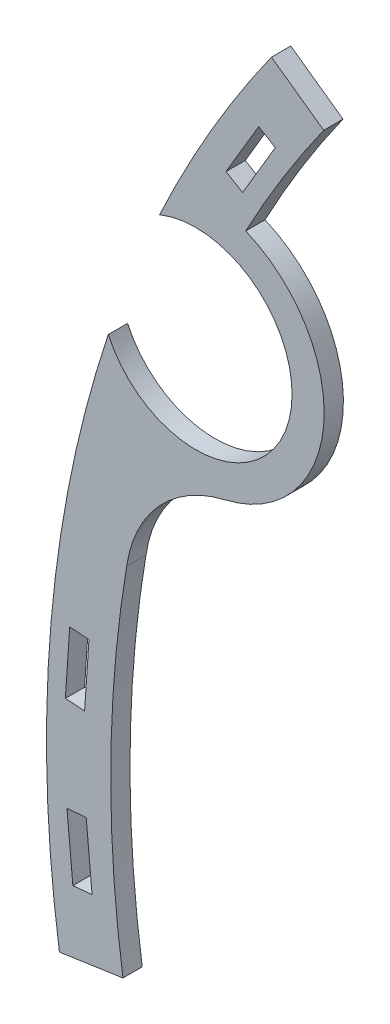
ISO-10303-21;
HEADER;
FILE_DESCRIPTION(('STEP AP214'),'2;1');
FILE_NAME('part.step','',(''),(''),'','','');
FILE_SCHEMA(('AUTOMOTIVE_DESIGN { 1 0 10303 214 1 1 1 1 }'));
ENDSEC;
DATA;
#1=APPLICATION_CONTEXT('core data for automotive mechanical design processes');
#2=APPLICATION_PROTOCOL_DEFINITION('international standard','automotive_design',2000,#1);
#3=PRODUCT_CONTEXT('',#1,'mechanical');
#4=PRODUCT('Part','Part','',(#3));
#5=PRODUCT_RELATED_PRODUCT_CATEGORY('part','',(#4));
#6=PRODUCT_DEFINITION_FORMATION('','',#4);
#7=PRODUCT_DEFINITION_CONTEXT('part definition',#1,'design');
#8=PRODUCT_DEFINITION('design','',#6,#7);
#9=PRODUCT_DEFINITION_SHAPE('','',#8);
#10=(LENGTH_UNIT() NAMED_UNIT(*) SI_UNIT(.MILLI.,.METRE.));
#11=(NAMED_UNIT(*) PLANE_ANGLE_UNIT() SI_UNIT($,.RADIAN.));
#12=(NAMED_UNIT(*) SI_UNIT($,.STERADIAN.) SOLID_ANGLE_UNIT());
#13=UNCERTAINTY_MEASURE_WITH_UNIT(LENGTH_MEASURE(1.E-05),#10,'distance_accuracy_value','');
#14=(GEOMETRIC_REPRESENTATION_CONTEXT(3) GLOBAL_UNCERTAINTY_ASSIGNED_CONTEXT((#13)) GLOBAL_UNIT_ASSIGNED_CONTEXT((#10,
#11,#12)) REPRESENTATION_CONTEXT('',''));
#15=CARTESIAN_POINT('',(0.,0.,0.));
#16=DIRECTION('',(0.,0.,1.));
#17=DIRECTION('',(1.,0.,0.));
#18=AXIS2_PLACEMENT_3D('',#15,#16,#17);
#19=CARTESIAN_POINT('',(-0.335882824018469,3.64820701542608,3.));
#20=DIRECTION('',(-0.0916801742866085,0.995788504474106,0.));
#21=DIRECTION('',(-0.995788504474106,-0.0916801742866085,0.));
#22=AXIS2_PLACEMENT_3D('',#19,#20,#21);
#23=PLANE('',#22);
#24=DIRECTION('',(0.995788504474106,0.0916801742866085,0.));
#25=VECTOR('',#24,1.);
#26=CARTESIAN_POINT('',(-0.335882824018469,3.64820701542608,0.));
#27=LINE('',#26,#25);
#28=CARTESIAN_POINT('',(-186.108637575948,-13.4555037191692,0.));
#29=VERTEX_POINT('',#28);
#30=CARTESIAN_POINT('',(-183.114306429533,-13.1798218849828,0.));
#31=VERTEX_POINT('',#30);
#32=EDGE_CURVE('E257',#29,#31,#27,.T.);
#33=ORIENTED_EDGE('',*,*,#32,.T.);
#34=DIRECTION('',(0.,0.,-1.));
#35=VECTOR('',#34,1.);
#36=CARTESIAN_POINT('',(-183.114306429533,-13.1798218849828,3.));
#37=LINE('',#36,#35);
#38=CARTESIAN_POINT('',(-183.114306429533,-13.1798218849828,3.));
#39=VERTEX_POINT('',#38);
#40=EDGE_CURVE('E11',#39,#31,#37,.T.);
#41=ORIENTED_EDGE('',*,*,#40,.F.);
#42=DIRECTION('',(0.995788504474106,0.0916801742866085,0.));
#43=VECTOR('',#42,1.);
#44=CARTESIAN_POINT('',(-0.335882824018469,3.64820701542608,3.));
#45=LINE('',#44,#43);
#46=CARTESIAN_POINT('',(-186.108637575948,-13.4555037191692,3.));
#47=VERTEX_POINT('',#46);
#48=EDGE_CURVE('E192',#47,#39,#45,.T.);
#49=ORIENTED_EDGE('',*,*,#48,.F.);
#50=DIRECTION('',(0.,0.,-1.));
#51=VECTOR('',#50,1.);
#52=CARTESIAN_POINT('',(-186.108637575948,-13.4555037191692,3.));
#53=LINE('',#52,#51);
#54=EDGE_CURVE('E54',#47,#29,#53,.T.);
#55=ORIENTED_EDGE('',*,*,#54,.T.);
#56=EDGE_LOOP('',(#33,#41,#49,#55));
#57=FACE_BOUND('',#56,.T.);
#58=ADVANCED_FACE('F35',(#57),#23,.F.);
#59=CARTESIAN_POINT('',(-182.778423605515,-16.8280289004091,3.));
#60=DIRECTION('',(0.995788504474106,0.0916801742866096,0.));
#61=DIRECTION('',(-0.0916801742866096,0.995788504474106,0.));
#62=AXIS2_PLACEMENT_3D('',#59,#60,#61);
#63=PLANE('',#62);
#64=DIRECTION('',(0.0916801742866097,-0.995788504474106,0.));
#65=VECTOR('',#64,1.);
#66=CARTESIAN_POINT('',(-182.778423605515,-16.8280289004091,0.));
#67=LINE('',#66,#65);
#68=CARTESIAN_POINT('',(-182.197504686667,-23.1377069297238,0.));
#69=VERTEX_POINT('',#68);
#70=EDGE_CURVE('E198',#31,#69,#67,.T.);
#71=ORIENTED_EDGE('',*,*,#70,.T.);
#72=DIRECTION('',(0.,0.,-1.));
#73=VECTOR('',#72,1.);
#74=CARTESIAN_POINT('',(-182.197504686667,-23.1377069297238,3.));
#75=LINE('',#74,#73);
#76=CARTESIAN_POINT('',(-182.197504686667,-23.1377069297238,3.));
#77=VERTEX_POINT('',#76);
#78=EDGE_CURVE('E45',#77,#69,#75,.T.);
#79=ORIENTED_EDGE('',*,*,#78,.F.);
#80=DIRECTION('',(0.0916801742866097,-0.995788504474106,0.));
#81=VECTOR('',#80,1.);
#82=CARTESIAN_POINT('',(-182.778423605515,-16.8280289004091,3.));
#83=LINE('',#82,#81);
#84=EDGE_CURVE('E186',#39,#77,#83,.T.);
#85=ORIENTED_EDGE('',*,*,#84,.F.);
#86=ORIENTED_EDGE('',*,*,#40,.T.);
#87=EDGE_LOOP('',(#71,#79,#85,#86));
#88=FACE_BOUND('',#87,.T.);
#89=ADVANCED_FACE('F197',(#88),#63,.F.);
#90=CARTESIAN_POINT('',(0.580918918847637,-6.30967802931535,3.));
#91=DIRECTION('',(-0.0916801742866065,0.995788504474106,0.));
#92=DIRECTION('',(-0.995788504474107,-0.0916801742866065,0.));
#93=AXIS2_PLACEMENT_3D('',#90,#91,#92);
#94=PLANE('',#93);
#95=DIRECTION('',(0.995788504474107,0.0916801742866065,0.));
#96=VECTOR('',#95,1.);
#97=CARTESIAN_POINT('',(0.580918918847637,-6.30967802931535,0.));
#98=LINE('',#97,#96);
#99=CARTESIAN_POINT('',(-185.191835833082,-23.4133887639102,0.));
#100=VERTEX_POINT('',#99);
#101=EDGE_CURVE('E260',#100,#69,#98,.T.);
#102=ORIENTED_EDGE('',*,*,#101,.F.);
#103=DIRECTION('',(0.,0.,-1.));
#104=VECTOR('',#103,1.);
#105=CARTESIAN_POINT('',(-185.191835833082,-23.4133887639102,3.));
#106=LINE('',#105,#104);
#107=CARTESIAN_POINT('',(-185.191835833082,-23.4133887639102,3.));
#108=VERTEX_POINT('',#107);
#109=EDGE_CURVE('E119',#108,#100,#106,.T.);
#110=ORIENTED_EDGE('',*,*,#109,.F.);
#111=DIRECTION('',(0.995788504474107,0.0916801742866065,0.));
#112=VECTOR('',#111,1.);
#113=CARTESIAN_POINT('',(0.580918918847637,-6.30967802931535,3.));
#114=LINE('',#113,#112);
#115=EDGE_CURVE('E191',#108,#77,#114,.T.);
#116=ORIENTED_EDGE('',*,*,#115,.T.);
#117=ORIENTED_EDGE('',*,*,#78,.T.);
#118=EDGE_LOOP('',(#102,#110,#116,#117));
#119=FACE_BOUND('',#118,.T.);
#120=ADVANCED_FACE('F202',(#119),#94,.T.);
#121=CARTESIAN_POINT('',(-182.586507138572,12.4759264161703,3.));
#122=DIRECTION('',(-0.997673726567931,0.068169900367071,0.));
#123=DIRECTION('',(-0.068169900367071,-0.997673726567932,0.));
#124=AXIS2_PLACEMENT_3D('',#121,#122,#123);
#125=PLANE('',#124);
#126=DIRECTION('',(0.068169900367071,0.997673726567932,0.));
#127=VECTOR('',#126,1.);
#128=CARTESIAN_POINT('',(-182.586507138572,12.4759264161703,0.));
#129=LINE('',#128,#127);
#130=CARTESIAN_POINT('',(-183.36625925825,1.06417139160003,0.));
#131=VERTEX_POINT('',#130);
#132=CARTESIAN_POINT('',(-182.684560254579,11.0409086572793,0.));
#133=VERTEX_POINT('',#132);
#134=EDGE_CURVE('E245',#131,#133,#129,.T.);
#135=ORIENTED_EDGE('',*,*,#134,.F.);
#136=DIRECTION('',(0.,0.,-1.));
#137=VECTOR('',#136,1.);
#138=CARTESIAN_POINT('',(-183.36625925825,1.06417139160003,3.));
#139=LINE('',#138,#137);
#140=CARTESIAN_POINT('',(-183.36625925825,1.06417139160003,3.));
#141=VERTEX_POINT('',#140);
#142=EDGE_CURVE('E267',#141,#131,#139,.T.);
#143=ORIENTED_EDGE('',*,*,#142,.F.);
#144=DIRECTION('',(0.068169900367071,0.997673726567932,0.));
#145=VECTOR('',#144,1.);
#146=CARTESIAN_POINT('',(-182.586507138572,12.4759264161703,3.));
#147=LINE('',#146,#145);
#148=CARTESIAN_POINT('',(-182.684560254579,11.0409086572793,3.));
#149=VERTEX_POINT('',#148);
#150=EDGE_CURVE('E557',#141,#149,#147,.T.);
#151=ORIENTED_EDGE('',*,*,#150,.T.);
#152=DIRECTION('',(0.,0.,-1.));
#153=VECTOR('',#152,1.);
#154=CARTESIAN_POINT('',(-182.684560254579,11.0409086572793,3.));
#155=LINE('',#154,#153);
#156=EDGE_CURVE('E269',#149,#133,#155,.T.);
#157=ORIENTED_EDGE('',*,*,#156,.T.);
#158=EDGE_LOOP('',(#135,#143,#151,#157));
#159=FACE_BOUND('',#158,.T.);
#160=ADVANCED_FACE('F376',(#159),#125,.T.);
#161=CARTESIAN_POINT('',(-0.779752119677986,-11.4117550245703,3.));
#162=DIRECTION('',(0.068169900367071,0.997673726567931,0.));
#163=DIRECTION('',(-0.997673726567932,0.068169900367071,0.));
#164=AXIS2_PLACEMENT_3D('',#161,#162,#163);
#165=PLANE('',#164);
#166=DIRECTION('',(0.997673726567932,-0.068169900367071,0.));
#167=VECTOR('',#166,1.);
#168=CARTESIAN_POINT('',(-0.779752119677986,-11.4117550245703,0.));
#169=LINE('',#168,#167);
#170=CARTESIAN_POINT('',(-186.36625925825,1.26915794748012,0.));
#171=VERTEX_POINT('',#170);
#172=EDGE_CURVE('E248',#171,#131,#169,.T.);
#173=ORIENTED_EDGE('',*,*,#172,.F.);
#174=DIRECTION('',(0.,0.,-1.));
#175=VECTOR('',#174,1.);
#176=CARTESIAN_POINT('',(-186.36625925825,1.26915794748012,3.));
#177=LINE('',#176,#175);
#178=CARTESIAN_POINT('',(-186.36625925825,1.26915794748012,3.));
#179=VERTEX_POINT('',#178);
#180=EDGE_CURVE('E275',#179,#171,#177,.T.);
#181=ORIENTED_EDGE('',*,*,#180,.F.);
#182=DIRECTION('',(0.997673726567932,-0.068169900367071,0.));
#183=VECTOR('',#182,1.);
#184=CARTESIAN_POINT('',(-0.779752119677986,-11.4117550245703,3.));
#185=LINE('',#184,#183);
#186=EDGE_CURVE('E560',#179,#141,#185,.T.);
#187=ORIENTED_EDGE('',*,*,#186,.T.);
#188=ORIENTED_EDGE('',*,*,#142,.T.);
#189=EDGE_LOOP('',(#173,#181,#187,#188));
#190=FACE_BOUND('',#189,.T.);
#191=ADVANCED_FACE('F372',(#190),#165,.T.);
#192=CARTESIAN_POINT('',(-185.586507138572,12.6809129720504,3.));
#193=DIRECTION('',(-0.997673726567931,0.068169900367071,0.));
#194=DIRECTION('',(-0.068169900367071,-0.997673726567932,0.));
#195=AXIS2_PLACEMENT_3D('',#192,#193,#194);
#196=PLANE('',#195);
#197=DIRECTION('',(0.068169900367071,0.997673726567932,0.));
#198=VECTOR('',#197,1.);
#199=CARTESIAN_POINT('',(-185.586507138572,12.6809129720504,0.));
#200=LINE('',#199,#198);
#201=CARTESIAN_POINT('',(-185.684560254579,11.2458952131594,0.));
#202=VERTEX_POINT('',#201);
#203=EDGE_CURVE('E251',#171,#202,#200,.T.);
#204=ORIENTED_EDGE('',*,*,#203,.T.);
#205=DIRECTION('',(0.,0.,-1.));
#206=VECTOR('',#205,1.);
#207=CARTESIAN_POINT('',(-185.684560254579,11.2458952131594,3.));
#208=LINE('',#207,#206);
#209=CARTESIAN_POINT('',(-185.684560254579,11.2458952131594,3.));
#210=VERTEX_POINT('',#209);
#211=EDGE_CURVE('E271',#210,#202,#208,.T.);
#212=ORIENTED_EDGE('',*,*,#211,.F.);
#213=DIRECTION('',(0.068169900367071,0.997673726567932,0.));
#214=VECTOR('',#213,1.);
#215=CARTESIAN_POINT('',(-185.586507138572,12.6809129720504,3.));
#216=LINE('',#215,#214);
#217=EDGE_CURVE('E568',#179,#210,#216,.T.);
#218=ORIENTED_EDGE('',*,*,#217,.F.);
#219=ORIENTED_EDGE('',*,*,#180,.T.);
#220=EDGE_LOOP('',(#204,#212,#218,#219));
#221=FACE_BOUND('',#220,.T.);
#222=ADVANCED_FACE('F368',(#221),#196,.F.);
#223=CARTESIAN_POINT('',(-154.085313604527,91.208925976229,3.));
#224=DIRECTION('',(-0.860538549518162,0.509385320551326,0.));
#225=DIRECTION('',(-0.509385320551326,-0.860538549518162,0.));
#226=AXIS2_PLACEMENT_3D('',#223,#224,#225);
#227=PLANE('',#226);
#228=DIRECTION('',(0.509385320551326,0.860538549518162,0.));
#229=VECTOR('',#228,1.);
#230=CARTESIAN_POINT('',(-154.085313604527,91.208925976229,0.));
#231=LINE('',#230,#229);
#232=CARTESIAN_POINT('',(-158.744235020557,83.3382997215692,0.));
#233=VERTEX_POINT('',#232);
#234=CARTESIAN_POINT('',(-153.650381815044,91.9436852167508,0.));
#235=VERTEX_POINT('',#234);
#236=EDGE_CURVE('E233',#233,#235,#231,.T.);
#237=ORIENTED_EDGE('',*,*,#236,.F.);
#238=DIRECTION('',(0.,0.,-1.));
#239=VECTOR('',#238,1.);
#240=CARTESIAN_POINT('',(-158.744235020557,83.3382997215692,3.));
#241=LINE('',#240,#239);
#242=CARTESIAN_POINT('',(-158.744235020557,83.3382997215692,3.));
#243=VERTEX_POINT('',#242);
#244=EDGE_CURVE('E272',#243,#233,#241,.T.);
#245=ORIENTED_EDGE('',*,*,#244,.F.);
#246=DIRECTION('',(0.509385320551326,0.860538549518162,0.));
#247=VECTOR('',#246,1.);
#248=CARTESIAN_POINT('',(-154.085313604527,91.208925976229,3.));
#249=LINE('',#248,#247);
#250=CARTESIAN_POINT('',(-153.650381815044,91.9436852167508,3.));
#251=VERTEX_POINT('',#250);
#252=EDGE_CURVE('E552',#243,#251,#249,.T.);
#253=ORIENTED_EDGE('',*,*,#252,.T.);
#254=DIRECTION('',(0.,0.,-1.));
#255=VECTOR('',#254,1.);
#256=CARTESIAN_POINT('',(-153.650381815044,91.9436852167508,3.));
#257=LINE('',#256,#255);
#258=EDGE_CURVE('E278',#251,#235,#257,.T.);
#259=ORIENTED_EDGE('',*,*,#258,.T.);
#260=EDGE_LOOP('',(#237,#245,#253,#259));
#261=FACE_BOUND('',#260,.T.);
#262=ADVANCED_FACE('F371',(#261),#227,.T.);
#263=CARTESIAN_POINT('',(-4.65892141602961,-7.87062625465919,3.));
#264=DIRECTION('',(0.509385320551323,0.860538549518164,0.));
#265=DIRECTION('',(-0.860538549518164,0.509385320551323,0.));
#266=AXIS2_PLACEMENT_3D('',#263,#264,#265);
#267=PLANE('',#266);
#268=DIRECTION('',(0.860538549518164,-0.509385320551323,0.));
#269=VECTOR('',#268,1.);
#270=CARTESIAN_POINT('',(-4.65892141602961,-7.87062625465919,0.));
#271=LINE('',#270,#269);
#272=CARTESIAN_POINT('',(-161.331870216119,84.8700188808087,0.));
#273=VERTEX_POINT('',#272);
#274=EDGE_CURVE('E236',#273,#233,#271,.T.);
#275=ORIENTED_EDGE('',*,*,#274,.F.);
#276=DIRECTION('',(0.,0.,-1.));
#277=VECTOR('',#276,1.);
#278=CARTESIAN_POINT('',(-161.331870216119,84.8700188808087,3.));
#279=LINE('',#278,#277);
#280=CARTESIAN_POINT('',(-161.331870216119,84.8700188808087,3.));
#281=VERTEX_POINT('',#280);
#282=EDGE_CURVE('E283',#281,#273,#279,.T.);
#283=ORIENTED_EDGE('',*,*,#282,.F.);
#284=DIRECTION('',(0.860538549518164,-0.509385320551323,0.));
#285=VECTOR('',#284,1.);
#286=CARTESIAN_POINT('',(-4.65892141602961,-7.87062625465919,3.));
#287=LINE('',#286,#285);
#288=EDGE_CURVE('E577',#281,#243,#287,.T.);
#289=ORIENTED_EDGE('',*,*,#288,.T.);
#290=ORIENTED_EDGE('',*,*,#244,.T.);
#291=EDGE_LOOP('',(#275,#283,#289,#290));
#292=FACE_BOUND('',#291,.T.);
#293=ADVANCED_FACE('F387',(#292),#267,.T.);
#294=CARTESIAN_POINT('',(-156.672948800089,92.7406451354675,3.));
#295=DIRECTION('',(-0.860538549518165,0.509385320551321,0.));
#296=DIRECTION('',(-0.509385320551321,-0.860538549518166,0.));
#297=AXIS2_PLACEMENT_3D('',#294,#295,#296);
#298=PLANE('',#297);
#299=DIRECTION('',(0.509385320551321,0.860538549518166,0.));
#300=VECTOR('',#299,1.);
#301=CARTESIAN_POINT('',(-156.672948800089,92.7406451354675,0.));
#302=LINE('',#301,#300);
#303=CARTESIAN_POINT('',(-156.238017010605,93.4754043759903,0.));
#304=VERTEX_POINT('',#303);
#305=EDGE_CURVE('E239',#273,#304,#302,.T.);
#306=ORIENTED_EDGE('',*,*,#305,.T.);
#307=DIRECTION('',(0.,0.,-1.));
#308=VECTOR('',#307,1.);
#309=CARTESIAN_POINT('',(-156.238017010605,93.4754043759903,3.));
#310=LINE('',#309,#308);
#311=CARTESIAN_POINT('',(-156.238017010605,93.4754043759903,3.));
#312=VERTEX_POINT('',#311);
#313=EDGE_CURVE('E280',#312,#304,#310,.T.);
#314=ORIENTED_EDGE('',*,*,#313,.F.);
#315=DIRECTION('',(0.509385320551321,0.860538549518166,0.));
#316=VECTOR('',#315,1.);
#317=CARTESIAN_POINT('',(-156.672948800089,92.7406451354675,3.));
#318=LINE('',#317,#316);
#319=EDGE_CURVE('E574',#281,#312,#318,.T.);
#320=ORIENTED_EDGE('',*,*,#319,.F.);
#321=ORIENTED_EDGE('',*,*,#282,.T.);
#322=EDGE_LOOP('',(#306,#314,#320,#321));
#323=FACE_BOUND('',#322,.T.);
#324=ADVANCED_FACE('F384',(#323),#298,.F.);
#325=CARTESIAN_POINT('',(0.,-5.88022373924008,3.));
#326=DIRECTION('',(0.,0.,-1.));
#327=DIRECTION('',(-1.,0.,0.));
#328=AXIS2_PLACEMENT_3D('',#325,#326,#327);
#329=CYLINDRICAL_SURFACE('',#328,179.295070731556);
#330=CARTESIAN_POINT('',(0.,-5.88022373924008,0.));
#331=DIRECTION('',(0.,0.,1.));
#332=DIRECTION('',(1.,0.,0.));
#333=AXIS2_PLACEMENT_3D('',#330,#331,#332);
#334=CIRCLE('',#333,179.295070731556);
#335=CARTESIAN_POINT('',(-176.802619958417,23.9116537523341,0.));
#336=VERTEX_POINT('',#335);
#337=CARTESIAN_POINT('',(-177.385555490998,-31.9778690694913,0.));
#338=VERTEX_POINT('',#337);
#339=EDGE_CURVE('E209',#336,#338,#334,.T.);
#340=ORIENTED_EDGE('',*,*,#339,.F.);
#341=DIRECTION('',(0.,0.,-1.));
#342=VECTOR('',#341,1.);
#343=CARTESIAN_POINT('',(-176.802619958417,23.9116537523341,3.));
#344=LINE('',#343,#342);
#345=CARTESIAN_POINT('',(-176.802619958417,23.9116537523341,3.));
#346=VERTEX_POINT('',#345);
#347=EDGE_CURVE('E39',#346,#336,#344,.T.);
#348=ORIENTED_EDGE('',*,*,#347,.F.);
#349=CARTESIAN_POINT('',(0.,-5.88022373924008,3.));
#350=DIRECTION('',(0.,0.,1.));
#351=DIRECTION('',(1.,0.,0.));
#352=AXIS2_PLACEMENT_3D('',#349,#350,#351);
#353=CIRCLE('',#352,179.295070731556);
#354=CARTESIAN_POINT('',(-177.385555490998,-31.9778690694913,3.));
#355=VERTEX_POINT('',#354);
#356=EDGE_CURVE('E265',#346,#355,#353,.T.);
#357=ORIENTED_EDGE('',*,*,#356,.T.);
#358=DIRECTION('',(0.,0.,-1.));
#359=VECTOR('',#358,1.);
#360=CARTESIAN_POINT('',(-177.385555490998,-31.9778690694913,3.));
#361=LINE('',#360,#359);
#362=EDGE_CURVE('E205',#355,#338,#361,.T.);
#363=ORIENTED_EDGE('',*,*,#362,.T.);
#364=EDGE_LOOP('',(#340,#348,#357,#363));
#365=FACE_BOUND('',#364,.T.);
#366=ADVANCED_FACE('F37',(#365),#329,.F.);
#367=CARTESIAN_POINT('',(-157.015424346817,21.0018616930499,3.));
#368=DIRECTION('',(0.,0.,-1.));
#369=DIRECTION('',(-1.,0.,0.));
#370=AXIS2_PLACEMENT_3D('',#367,#368,#369);
#371=CYLINDRICAL_SURFACE('',#370,20.);
#372=CARTESIAN_POINT('',(-157.015424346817,21.0018616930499,0.));
#373=DIRECTION('',(0.,0.,1.));
#374=DIRECTION('',(1.,0.,0.));
#375=AXIS2_PLACEMENT_3D('',#372,#373,#374);
#376=CIRCLE('',#375,20.);
#377=CARTESIAN_POINT('',(-161.526224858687,40.4865397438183,0.));
#378=VERTEX_POINT('',#377);
#379=EDGE_CURVE('E212',#336,#378,#376,.F.);
#380=ORIENTED_EDGE('',*,*,#379,.T.);
#381=DIRECTION('',(0.,0.,-1.));
#382=VECTOR('',#381,1.);
#383=CARTESIAN_POINT('',(-161.526224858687,40.4865397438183,3.));
#384=LINE('',#383,#382);
#385=CARTESIAN_POINT('',(-161.526224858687,40.4865397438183,3.));
#386=VERTEX_POINT('',#385);
#387=EDGE_CURVE('E299',#386,#378,#384,.T.);
#388=ORIENTED_EDGE('',*,*,#387,.F.);
#389=CARTESIAN_POINT('',(-157.015424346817,21.0018616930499,3.));
#390=DIRECTION('',(0.,0.,1.));
#391=DIRECTION('',(1.,0.,0.));
#392=AXIS2_PLACEMENT_3D('',#389,#390,#391);
#393=CIRCLE('',#392,20.);
#394=EDGE_CURVE('E308',#346,#386,#393,.F.);
#395=ORIENTED_EDGE('',*,*,#394,.F.);
#396=ORIENTED_EDGE('',*,*,#347,.T.);
#397=EDGE_LOOP('',(#380,#388,#395,#396));
#398=FACE_BOUND('',#397,.T.);
#399=ADVANCED_FACE('F307',(#398),#371,.F.);
#400=CARTESIAN_POINT('',(-166.037025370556,59.9712177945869,3.));
#401=DIRECTION('',(0.,0.,-1.));
#402=DIRECTION('',(-1.,0.,0.));
#403=AXIS2_PLACEMENT_3D('',#400,#401,#402);
#404=CYLINDRICAL_SURFACE('',#403,19.9999999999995);
#405=CARTESIAN_POINT('',(-166.037025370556,59.9712177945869,0.));
#406=DIRECTION('',(0.,0.,1.));
#407=DIRECTION('',(1.,0.,0.));
#408=AXIS2_PLACEMENT_3D('',#405,#406,#407);
#409=CIRCLE('',#408,19.9999999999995);
#410=CARTESIAN_POINT('',(-158.258899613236,78.396764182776,0.));
#411=VERTEX_POINT('',#410);
#412=EDGE_CURVE('E214',#378,#411,#409,.T.);
#413=ORIENTED_EDGE('',*,*,#412,.T.);
#414=DIRECTION('',(0.,0.,-1.));
#415=VECTOR('',#414,1.);
#416=CARTESIAN_POINT('',(-158.258899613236,78.396764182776,3.));
#417=LINE('',#416,#415);
#418=CARTESIAN_POINT('',(-158.258899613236,78.396764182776,3.));
#419=VERTEX_POINT('',#418);
#420=EDGE_CURVE('E298',#419,#411,#417,.T.);
#421=ORIENTED_EDGE('',*,*,#420,.F.);
#422=CARTESIAN_POINT('',(-166.037025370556,59.9712177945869,3.));
#423=DIRECTION('',(0.,0.,1.));
#424=DIRECTION('',(1.,0.,0.));
#425=AXIS2_PLACEMENT_3D('',#422,#423,#424);
#426=CIRCLE('',#425,19.9999999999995);
#427=EDGE_CURVE('E588',#386,#419,#426,.T.);
#428=ORIENTED_EDGE('',*,*,#427,.F.);
#429=ORIENTED_EDGE('',*,*,#387,.T.);
#430=EDGE_LOOP('',(#413,#421,#428,#429));
#431=FACE_BOUND('',#430,.T.);
#432=ADVANCED_FACE('F346',(#431),#404,.T.);
#433=CARTESIAN_POINT('',(0.,-5.88022373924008,3.));
#434=DIRECTION('',(0.,0.,-1.));
#435=DIRECTION('',(-1.,0.,0.));
#436=AXIS2_PLACEMENT_3D('',#433,#434,#435);
#437=CYLINDRICAL_SURFACE('',#436,179.3);
#438=CARTESIAN_POINT('',(0.,-5.88022373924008,0.));
#439=DIRECTION('',(0.,0.,1.));
#440=DIRECTION('',(1.,0.,0.));
#441=AXIS2_PLACEMENT_3D('',#438,#439,#440);
#442=CIRCLE('',#441,179.3);
#443=CARTESIAN_POINT('',(-146.100177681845,98.0583546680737,0.));
#444=VERTEX_POINT('',#443);
#445=EDGE_CURVE('E217',#444,#411,#442,.T.);
#446=ORIENTED_EDGE('',*,*,#445,.F.);
#447=DIRECTION('',(0.,0.,-1.));
#448=VECTOR('',#447,1.);
#449=CARTESIAN_POINT('',(-146.100177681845,98.0583546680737,3.));
#450=LINE('',#449,#448);
#451=CARTESIAN_POINT('',(-146.100177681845,98.0583546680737,3.));
#452=VERTEX_POINT('',#451);
#453=EDGE_CURVE('E296',#452,#444,#450,.T.);
#454=ORIENTED_EDGE('',*,*,#453,.F.);
#455=CARTESIAN_POINT('',(0.,-5.88022373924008,3.));
#456=DIRECTION('',(0.,0.,1.));
#457=DIRECTION('',(1.,0.,0.));
#458=AXIS2_PLACEMENT_3D('',#455,#456,#457);
#459=CIRCLE('',#458,179.3);
#460=EDGE_CURVE('E345',#452,#419,#459,.T.);
#461=ORIENTED_EDGE('',*,*,#460,.T.);
#462=ORIENTED_EDGE('',*,*,#420,.T.);
#463=EDGE_LOOP('',(#446,#454,#461,#462));
#464=FACE_BOUND('',#463,.T.);
#465=ADVANCED_FACE('F343',(#464),#437,.F.);
#466=CARTESIAN_POINT('',(-2.77754298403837,-3.90422429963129,3.));
#467=DIRECTION('',(0.57969090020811,0.814836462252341,0.));
#468=DIRECTION('',(-0.814836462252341,0.57969090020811,0.));
#469=AXIS2_PLACEMENT_3D('',#466,#467,#468);
#470=PLANE('',#469);
#471=DIRECTION('',(0.814836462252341,-0.57969090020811,0.));
#472=VECTOR('',#471,1.);
#473=CARTESIAN_POINT('',(-2.77754298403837,-3.90422429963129,0.));
#474=LINE('',#473,#472);
#475=CARTESIAN_POINT('',(-154.248542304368,103.855263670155,0.));
#476=VERTEX_POINT('',#475);
#477=EDGE_CURVE('E220',#476,#444,#474,.T.);
#478=ORIENTED_EDGE('',*,*,#477,.F.);
#479=DIRECTION('',(0.,0.,-1.));
#480=VECTOR('',#479,1.);
#481=CARTESIAN_POINT('',(-154.248542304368,103.855263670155,3.));
#482=LINE('',#481,#480);
#483=CARTESIAN_POINT('',(-154.248542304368,103.855263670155,3.));
#484=VERTEX_POINT('',#483);
#485=EDGE_CURVE('E294',#484,#476,#482,.T.);
#486=ORIENTED_EDGE('',*,*,#485,.F.);
#487=DIRECTION('',(0.814836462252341,-0.57969090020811,0.));
#488=VECTOR('',#487,1.);
#489=CARTESIAN_POINT('',(-2.77754298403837,-3.90422429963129,3.));
#490=LINE('',#489,#488);
#491=EDGE_CURVE('E339',#484,#452,#490,.T.);
#492=ORIENTED_EDGE('',*,*,#491,.T.);
#493=ORIENTED_EDGE('',*,*,#453,.T.);
#494=EDGE_LOOP('',(#478,#486,#492,#493));
#495=FACE_BOUND('',#494,.T.);
#496=ADVANCED_FACE('F335',(#495),#470,.T.);
#497=CARTESIAN_POINT('',(0.,-5.88022373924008,3.));
#498=DIRECTION('',(0.,0.,-1.));
#499=DIRECTION('',(-1.,0.,0.));
#500=AXIS2_PLACEMENT_3D('',#497,#498,#499);
#501=CYLINDRICAL_SURFACE('',#500,189.3);
#502=CARTESIAN_POINT('',(0.,-5.88022373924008,0.));
#503=DIRECTION('',(0.,0.,1.));
#504=DIRECTION('',(1.,0.,0.));
#505=AXIS2_PLACEMENT_3D('',#502,#503,#504);
#506=CIRCLE('',#505,189.3);
#507=CARTESIAN_POINT('',(-171.681723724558,73.8686053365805,0.));
#508=VERTEX_POINT('',#507);
#509=EDGE_CURVE('E223',#476,#508,#506,.T.);
#510=ORIENTED_EDGE('',*,*,#509,.T.);
#511=DIRECTION('',(0.,0.,-1.));
#512=VECTOR('',#511,1.);
#513=CARTESIAN_POINT('',(-171.681723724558,73.8686053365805,3.));
#514=LINE('',#513,#512);
#515=CARTESIAN_POINT('',(-171.681723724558,73.8686053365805,3.));
#516=VERTEX_POINT('',#515);
#517=EDGE_CURVE('E292',#516,#508,#514,.T.);
#518=ORIENTED_EDGE('',*,*,#517,.F.);
#519=CARTESIAN_POINT('',(0.,-5.88022373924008,3.));
#520=DIRECTION('',(0.,0.,1.));
#521=DIRECTION('',(1.,0.,0.));
#522=AXIS2_PLACEMENT_3D('',#519,#520,#521);
#523=CIRCLE('',#522,189.3);
#524=EDGE_CURVE('E584',#484,#516,#523,.T.);
#525=ORIENTED_EDGE('',*,*,#524,.F.);
#526=ORIENTED_EDGE('',*,*,#485,.T.);
#527=EDGE_LOOP('',(#510,#518,#525,#526));
#528=FACE_BOUND('',#527,.T.);
#529=ADVANCED_FACE('F332',(#528),#501,.T.);
#530=CARTESIAN_POINT('',(-166.037025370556,59.9712177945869,3.));
#531=DIRECTION('',(0.,0.,-1.));
#532=DIRECTION('',(-1.,0.,0.));
#533=AXIS2_PLACEMENT_3D('',#530,#531,#532);
#534=CYLINDRICAL_SURFACE('',#533,15.0000000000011);
#535=CARTESIAN_POINT('',(-166.037025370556,59.9712177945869,0.));
#536=DIRECTION('',(0.,0.,1.));
#537=DIRECTION('',(1.,0.,0.));
#538=AXIS2_PLACEMENT_3D('',#535,#536,#537);
#539=CIRCLE('',#538,15.0000000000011);
#540=CARTESIAN_POINT('',(-179.672595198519,53.7205189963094,0.));
#541=VERTEX_POINT('',#540);
#542=EDGE_CURVE('E226',#541,#508,#539,.T.);
#543=ORIENTED_EDGE('',*,*,#542,.F.);
#544=DIRECTION('',(0.,0.,-1.));
#545=VECTOR('',#544,1.);
#546=CARTESIAN_POINT('',(-179.672595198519,53.7205189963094,3.));
#547=LINE('',#546,#545);
#548=CARTESIAN_POINT('',(-179.672595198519,53.7205189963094,3.));
#549=VERTEX_POINT('',#548);
#550=EDGE_CURVE('E290',#549,#541,#547,.T.);
#551=ORIENTED_EDGE('',*,*,#550,.F.);
#552=CARTESIAN_POINT('',(-166.037025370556,59.9712177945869,3.));
#553=DIRECTION('',(0.,0.,1.));
#554=DIRECTION('',(1.,0.,0.));
#555=AXIS2_PLACEMENT_3D('',#552,#553,#554);
#556=CIRCLE('',#555,15.0000000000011);
#557=EDGE_CURVE('E329',#549,#516,#556,.T.);
#558=ORIENTED_EDGE('',*,*,#557,.T.);
#559=ORIENTED_EDGE('',*,*,#517,.T.);
#560=EDGE_LOOP('',(#543,#551,#558,#559));
#561=FACE_BOUND('',#560,.T.);
#562=ADVANCED_FACE('F324',(#561),#534,.F.);
#563=CARTESIAN_POINT('',(-187.283930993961,-33.4341561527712,0.));
#564=VERTEX_POINT('',#563);
#565=EDGE_CURVE('E227',#541,#564,#506,.T.);
#566=ORIENTED_EDGE('',*,*,#565,.T.);
#567=DIRECTION('',(0.,0.,-1.));
#568=VECTOR('',#567,1.);
#569=CARTESIAN_POINT('',(-187.283930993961,-33.4341561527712,3.));
#570=LINE('',#569,#568);
#571=CARTESIAN_POINT('',(-187.283930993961,-33.4341561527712,3.));
#572=VERTEX_POINT('',#571);
#573=EDGE_CURVE('E287',#572,#564,#570,.T.);
#574=ORIENTED_EDGE('',*,*,#573,.F.);
#575=EDGE_CURVE('E582',#549,#572,#523,.T.);
#576=ORIENTED_EDGE('',*,*,#575,.F.);
#577=ORIENTED_EDGE('',*,*,#550,.T.);
#578=EDGE_LOOP('',(#566,#574,#576,#577));
#579=FACE_BOUND('',#578,.T.);
#580=ADVANCED_FACE('F366',(#579),#501,.T.);
#581=CARTESIAN_POINT('',(-0.0980531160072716,-1.43501775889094,3.));
#582=DIRECTION('',(0.0681699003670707,0.997673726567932,0.));
#583=DIRECTION('',(-0.997673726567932,0.0681699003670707,0.));
#584=AXIS2_PLACEMENT_3D('',#581,#582,#583);
#585=PLANE('',#584);
#586=DIRECTION('',(0.997673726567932,-0.0681699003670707,0.));
#587=VECTOR('',#586,1.);
#588=CARTESIAN_POINT('',(-0.0980531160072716,-1.43501775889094,0.));
#589=LINE('',#588,#587);
#590=EDGE_CURVE('E254',#202,#133,#589,.T.);
#591=ORIENTED_EDGE('',*,*,#590,.T.);
#592=ORIENTED_EDGE('',*,*,#156,.F.);
#593=DIRECTION('',(0.997673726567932,-0.0681699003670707,0.));
#594=VECTOR('',#593,1.);
#595=CARTESIAN_POINT('',(-0.0980531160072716,-1.43501775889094,3.));
#596=LINE('',#595,#594);
#597=EDGE_CURVE('E561',#210,#149,#596,.T.);
#598=ORIENTED_EDGE('',*,*,#597,.F.);
#599=ORIENTED_EDGE('',*,*,#211,.T.);
#600=EDGE_LOOP('',(#591,#592,#598,#599));
#601=FACE_BOUND('',#600,.T.);
#602=ADVANCED_FACE('F362',(#601),#585,.F.);
#603=CARTESIAN_POINT('',(0.434931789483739,0.734759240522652,3.));
#604=DIRECTION('',(0.509385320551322,0.860538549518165,0.));
#605=DIRECTION('',(-0.860538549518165,0.509385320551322,0.));
#606=AXIS2_PLACEMENT_3D('',#603,#604,#605);
#607=PLANE('',#606);
#608=DIRECTION('',(0.860538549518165,-0.509385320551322,0.));
#609=VECTOR('',#608,1.);
#610=CARTESIAN_POINT('',(0.434931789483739,0.734759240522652,0.));
#611=LINE('',#610,#609);
#612=EDGE_CURVE('E242',#304,#235,#611,.T.);
#613=ORIENTED_EDGE('',*,*,#612,.T.);
#614=ORIENTED_EDGE('',*,*,#258,.F.);
#615=DIRECTION('',(0.860538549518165,-0.509385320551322,0.));
#616=VECTOR('',#615,1.);
#617=CARTESIAN_POINT('',(0.434931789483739,0.734759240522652,3.));
#618=LINE('',#617,#616);
#619=EDGE_CURVE('E563',#312,#251,#618,.T.);
#620=ORIENTED_EDGE('',*,*,#619,.F.);
#621=ORIENTED_EDGE('',*,*,#313,.T.);
#622=EDGE_LOOP('',(#613,#614,#620,#621));
#623=FACE_BOUND('',#622,.T.);
#624=ADVANCED_FACE('F365',(#623),#607,.F.);
#625=CARTESIAN_POINT('',(0.846791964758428,-5.75564044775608,3.));
#626=DIRECTION('',(-0.145556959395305,0.989349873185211,0.));
#627=DIRECTION('',(-0.989349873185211,-0.145556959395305,0.));
#628=AXIS2_PLACEMENT_3D('',#625,#626,#627);
#629=PLANE('',#628);
#630=DIRECTION('',(0.989349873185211,0.145556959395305,0.));
#631=VECTOR('',#630,1.);
#632=CARTESIAN_POINT('',(0.846791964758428,-5.75564044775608,0.));
#633=LINE('',#632,#631);
#634=EDGE_CURVE('E230',#564,#338,#633,.T.);
#635=ORIENTED_EDGE('',*,*,#634,.T.);
#636=ORIENTED_EDGE('',*,*,#362,.F.);
#637=DIRECTION('',(0.989349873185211,0.145556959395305,0.));
#638=VECTOR('',#637,1.);
#639=CARTESIAN_POINT('',(0.846791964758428,-5.75564044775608,3.));
#640=LINE('',#639,#638);
#641=EDGE_CURVE('E580',#572,#355,#640,.T.);
#642=ORIENTED_EDGE('',*,*,#641,.F.);
#643=ORIENTED_EDGE('',*,*,#573,.T.);
#644=EDGE_LOOP('',(#635,#636,#642,#643));
#645=FACE_BOUND('',#644,.T.);
#646=ADVANCED_FACE('F317',(#645),#629,.F.);
#647=CARTESIAN_POINT('',(-185.77275475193,-17.103710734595,3.));
#648=DIRECTION('',(0.995788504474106,0.0916801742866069,0.));
#649=DIRECTION('',(-0.0916801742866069,0.995788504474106,0.));
#650=AXIS2_PLACEMENT_3D('',#647,#648,#649);
#651=PLANE('',#650);
#652=DIRECTION('',(0.0916801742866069,-0.995788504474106,0.));
#653=VECTOR('',#652,1.);
#654=CARTESIAN_POINT('',(-185.77275475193,-17.103710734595,0.));
#655=LINE('',#654,#653);
#656=EDGE_CURVE('E262',#29,#100,#655,.T.);
#657=ORIENTED_EDGE('',*,*,#656,.F.);
#658=ORIENTED_EDGE('',*,*,#54,.F.);
#659=DIRECTION('',(0.0916801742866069,-0.995788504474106,0.));
#660=VECTOR('',#659,1.);
#661=CARTESIAN_POINT('',(-185.77275475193,-17.103710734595,3.));
#662=LINE('',#661,#660);
#663=EDGE_CURVE('E203',#47,#108,#662,.T.);
#664=ORIENTED_EDGE('',*,*,#663,.T.);
#665=ORIENTED_EDGE('',*,*,#109,.T.);
#666=EDGE_LOOP('',(#657,#658,#664,#665));
#667=FACE_BOUND('',#666,.T.);
#668=ADVANCED_FACE('F397',(#667),#651,.T.);
#669=CARTESIAN_POINT('',(0.,0.,3.));
#670=DIRECTION('',(0.,0.,1.));
#671=DIRECTION('',(1.,0.,0.));
#672=AXIS2_PLACEMENT_3D('',#669,#670,#671);
#673=PLANE('',#672);
#674=ORIENTED_EDGE('',*,*,#356,.F.);
#675=ORIENTED_EDGE('',*,*,#394,.T.);
#676=ORIENTED_EDGE('',*,*,#427,.T.);
#677=ORIENTED_EDGE('',*,*,#460,.F.);
#678=ORIENTED_EDGE('',*,*,#491,.F.);
#679=ORIENTED_EDGE('',*,*,#524,.T.);
#680=ORIENTED_EDGE('',*,*,#557,.F.);
#681=ORIENTED_EDGE('',*,*,#575,.T.);
#682=ORIENTED_EDGE('',*,*,#641,.T.);
#683=EDGE_LOOP('',(#674,#675,#676,#677,#678,#679,#680,#681,#682));
#684=FACE_BOUND('',#683,.T.);
#685=ORIENTED_EDGE('',*,*,#252,.F.);
#686=ORIENTED_EDGE('',*,*,#288,.F.);
#687=ORIENTED_EDGE('',*,*,#319,.T.);
#688=ORIENTED_EDGE('',*,*,#619,.T.);
#689=EDGE_LOOP('',(#685,#686,#687,#688));
#690=FACE_BOUND('',#689,.T.);
#691=ORIENTED_EDGE('',*,*,#150,.F.);
#692=ORIENTED_EDGE('',*,*,#186,.F.);
#693=ORIENTED_EDGE('',*,*,#217,.T.);
#694=ORIENTED_EDGE('',*,*,#597,.T.);
#695=EDGE_LOOP('',(#691,#692,#693,#694));
#696=FACE_BOUND('',#695,.T.);
#697=ORIENTED_EDGE('',*,*,#48,.T.);
#698=ORIENTED_EDGE('',*,*,#84,.T.);
#699=ORIENTED_EDGE('',*,*,#115,.F.);
#700=ORIENTED_EDGE('',*,*,#663,.F.);
#701=EDGE_LOOP('',(#697,#698,#699,#700));
#702=FACE_BOUND('',#701,.T.);
#703=ADVANCED_FACE('F188',(#684,#690,#696,#702),#673,.T.);
#704=CARTESIAN_POINT('',(0.,0.,0.));
#705=DIRECTION('',(0.,0.,1.));
#706=DIRECTION('',(1.,0.,0.));
#707=AXIS2_PLACEMENT_3D('',#704,#705,#706);
#708=PLANE('',#707);
#709=ORIENTED_EDGE('',*,*,#339,.T.);
#710=ORIENTED_EDGE('',*,*,#634,.F.);
#711=ORIENTED_EDGE('',*,*,#565,.F.);
#712=ORIENTED_EDGE('',*,*,#542,.T.);
#713=ORIENTED_EDGE('',*,*,#509,.F.);
#714=ORIENTED_EDGE('',*,*,#477,.T.);
#715=ORIENTED_EDGE('',*,*,#445,.T.);
#716=ORIENTED_EDGE('',*,*,#412,.F.);
#717=ORIENTED_EDGE('',*,*,#379,.F.);
#718=EDGE_LOOP('',(#709,#710,#711,#712,#713,#714,#715,#716,#717));
#719=FACE_BOUND('',#718,.T.);
#720=ORIENTED_EDGE('',*,*,#236,.T.);
#721=ORIENTED_EDGE('',*,*,#612,.F.);
#722=ORIENTED_EDGE('',*,*,#305,.F.);
#723=ORIENTED_EDGE('',*,*,#274,.T.);
#724=EDGE_LOOP('',(#720,#721,#722,#723));
#725=FACE_BOUND('',#724,.T.);
#726=ORIENTED_EDGE('',*,*,#134,.T.);
#727=ORIENTED_EDGE('',*,*,#590,.F.);
#728=ORIENTED_EDGE('',*,*,#203,.F.);
#729=ORIENTED_EDGE('',*,*,#172,.T.);
#730=EDGE_LOOP('',(#726,#727,#728,#729));
#731=FACE_BOUND('',#730,.T.);
#732=ORIENTED_EDGE('',*,*,#32,.F.);
#733=ORIENTED_EDGE('',*,*,#656,.T.);
#734=ORIENTED_EDGE('',*,*,#101,.T.);
#735=ORIENTED_EDGE('',*,*,#70,.F.);
#736=EDGE_LOOP('',(#732,#733,#734,#735));
#737=FACE_BOUND('',#736,.T.);
#738=ADVANCED_FACE('F311',(#719,#725,#731,#737),#708,.F.);
#739=CLOSED_SHELL('',(#58,#89,#120,#160,#191,#222,#262,#293,#324,#366,#399,#432,#465,#496,#529,
#562,#580,#602,#624,#646,#668,#703,#738));
#740=MANIFOLD_SOLID_BREP('B2',#739);
#741=ADVANCED_BREP_SHAPE_REPRESENTATION('',(#18,#740),#14);
#742=SHAPE_DEFINITION_REPRESENTATION(#9,#741);
ENDSEC;
END-ISO-10303-21;
